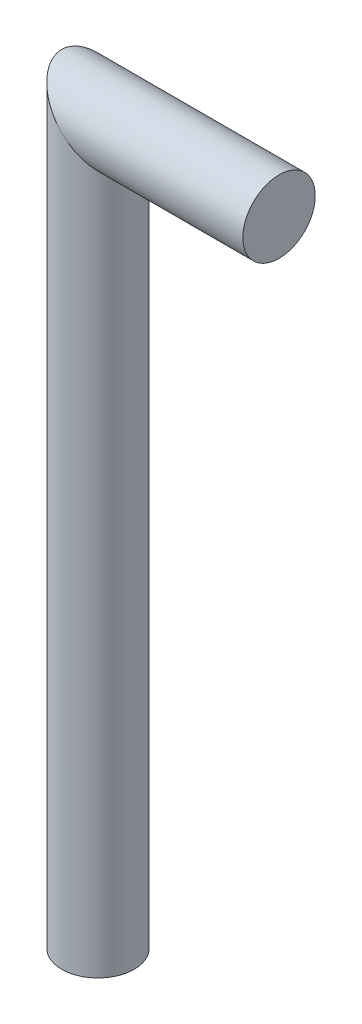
ISO-10303-21;
HEADER;
FILE_DESCRIPTION(('STEP AP214'),'2;1');
FILE_NAME('part.step','',(''),(''),'','','');
FILE_SCHEMA(('AUTOMOTIVE_DESIGN { 1 0 10303 214 1 1 1 1 }'));
ENDSEC;
DATA;
#1=APPLICATION_CONTEXT('core data for automotive mechanical design processes');
#2=APPLICATION_PROTOCOL_DEFINITION('international standard','automotive_design',2000,#1);
#3=PRODUCT_CONTEXT('',#1,'mechanical');
#4=PRODUCT('Part','Part','',(#3));
#5=PRODUCT_RELATED_PRODUCT_CATEGORY('part','',(#4));
#6=PRODUCT_DEFINITION_FORMATION('','',#4);
#7=PRODUCT_DEFINITION_CONTEXT('part definition',#1,'design');
#8=PRODUCT_DEFINITION('design','',#6,#7);
#9=PRODUCT_DEFINITION_SHAPE('','',#8);
#10=(LENGTH_UNIT() NAMED_UNIT(*) SI_UNIT(.MILLI.,.METRE.));
#11=(NAMED_UNIT(*) PLANE_ANGLE_UNIT() SI_UNIT($,.RADIAN.));
#12=(NAMED_UNIT(*) SI_UNIT($,.STERADIAN.) SOLID_ANGLE_UNIT());
#13=UNCERTAINTY_MEASURE_WITH_UNIT(LENGTH_MEASURE(1.E-05),#10,'distance_accuracy_value','');
#14=(GEOMETRIC_REPRESENTATION_CONTEXT(3) GLOBAL_UNCERTAINTY_ASSIGNED_CONTEXT((#13)) GLOBAL_UNIT_ASSIGNED_CONTEXT((#10,
#11,#12)) REPRESENTATION_CONTEXT('',''));
#15=CARTESIAN_POINT('',(0.,0.,0.));
#16=DIRECTION('',(0.,0.,1.));
#17=DIRECTION('',(1.,0.,0.));
#18=AXIS2_PLACEMENT_3D('',#15,#16,#17);
#19=CARTESIAN_POINT('',(30.,120.,0.));
#20=DIRECTION('',(1.,0.,0.));
#21=DIRECTION('',(0.,0.,1.));
#22=AXIS2_PLACEMENT_3D('',#19,#20,#21);
#23=PLANE('',#22);
#24=CARTESIAN_POINT('',(30.,120.,0.));
#25=DIRECTION('',(1.,0.,0.));
#26=DIRECTION('',(0.,0.,1.));
#27=AXIS2_PLACEMENT_3D('',#24,#25,#26);
#28=CIRCLE('',#27,6.);
#29=CARTESIAN_POINT('',(30.,120.,6.));
#30=VERTEX_POINT('',#29);
#31=EDGE_CURVE('E42',#30,#30,#28,.T.);
#32=ORIENTED_EDGE('',*,*,#31,.T.);
#33=EDGE_LOOP('',(#32));
#34=FACE_BOUND('',#33,.T.);
#35=ADVANCED_FACE('F39',(#34),#23,.T.);
#36=CARTESIAN_POINT('',(0.,0.,0.));
#37=DIRECTION('',(0.,1.,0.));
#38=DIRECTION('',(0.,0.,1.));
#39=AXIS2_PLACEMENT_3D('',#36,#37,#38);
#40=PLANE('',#39);
#41=CARTESIAN_POINT('',(0.,0.,0.));
#42=DIRECTION('',(0.,1.,0.));
#43=DIRECTION('',(0.,0.,1.));
#44=AXIS2_PLACEMENT_3D('',#41,#42,#43);
#45=CIRCLE('',#44,6.);
#46=CARTESIAN_POINT('',(0.,0.,6.));
#47=VERTEX_POINT('',#46);
#48=EDGE_CURVE('E48',#47,#47,#45,.T.);
#49=ORIENTED_EDGE('',*,*,#48,.F.);
#50=EDGE_LOOP('',(#49));
#51=FACE_BOUND('',#50,.T.);
#52=ADVANCED_FACE('F70',(#51),#40,.F.);
#53=CARTESIAN_POINT('',(-13.3,120.,0.));
#54=DIRECTION('',(1.,0.,0.));
#55=DIRECTION('',(0.,0.,-1.));
#56=AXIS2_PLACEMENT_3D('',#53,#54,#55);
#57=CYLINDRICAL_SURFACE('',#56,6.);
#58=CARTESIAN_POINT('',(0.,120.,0.));
#59=DIRECTION('',(0.707106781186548,0.707106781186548,0.));
#60=DIRECTION('',(-0.707106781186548,0.707106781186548,0.));
#61=AXIS2_PLACEMENT_3D('',#58,#59,#60);
#62=ELLIPSE('',#61,8.48528137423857,6.);
#63=CARTESIAN_POINT('',(-6.,126.,0.));
#64=VERTEX_POINT('',#63);
#65=EDGE_CURVE('E11',#64,#64,#62,.F.);
#66=ORIENTED_EDGE('',*,*,#65,.F.);
#67=EDGE_LOOP('',(#66));
#68=FACE_BOUND('',#67,.T.);
#69=ORIENTED_EDGE('',*,*,#31,.F.);
#70=EDGE_LOOP('',(#69));
#71=FACE_BOUND('',#70,.T.);
#72=ADVANCED_FACE('F60',(#68,#71),#57,.T.);
#73=CARTESIAN_POINT('',(0.,0.,0.));
#74=DIRECTION('',(0.,1.,0.));
#75=DIRECTION('',(0.,0.,1.));
#76=AXIS2_PLACEMENT_3D('',#73,#74,#75);
#77=CYLINDRICAL_SURFACE('',#76,6.);
#78=ORIENTED_EDGE('',*,*,#48,.T.);
#79=EDGE_LOOP('',(#78));
#80=FACE_BOUND('',#79,.T.);
#81=ORIENTED_EDGE('',*,*,#65,.T.);
#82=EDGE_LOOP('',(#81));
#83=FACE_BOUND('',#82,.T.);
#84=ADVANCED_FACE('F63',(#80,#83),#77,.T.);
#85=CLOSED_SHELL('',(#35,#52,#72,#84));
#86=MANIFOLD_SOLID_BREP('B2',#85);
#87=ADVANCED_BREP_SHAPE_REPRESENTATION('',(#18,#86),#14);
#88=SHAPE_DEFINITION_REPRESENTATION(#9,#87);
ENDSEC;
END-ISO-10303-21;
